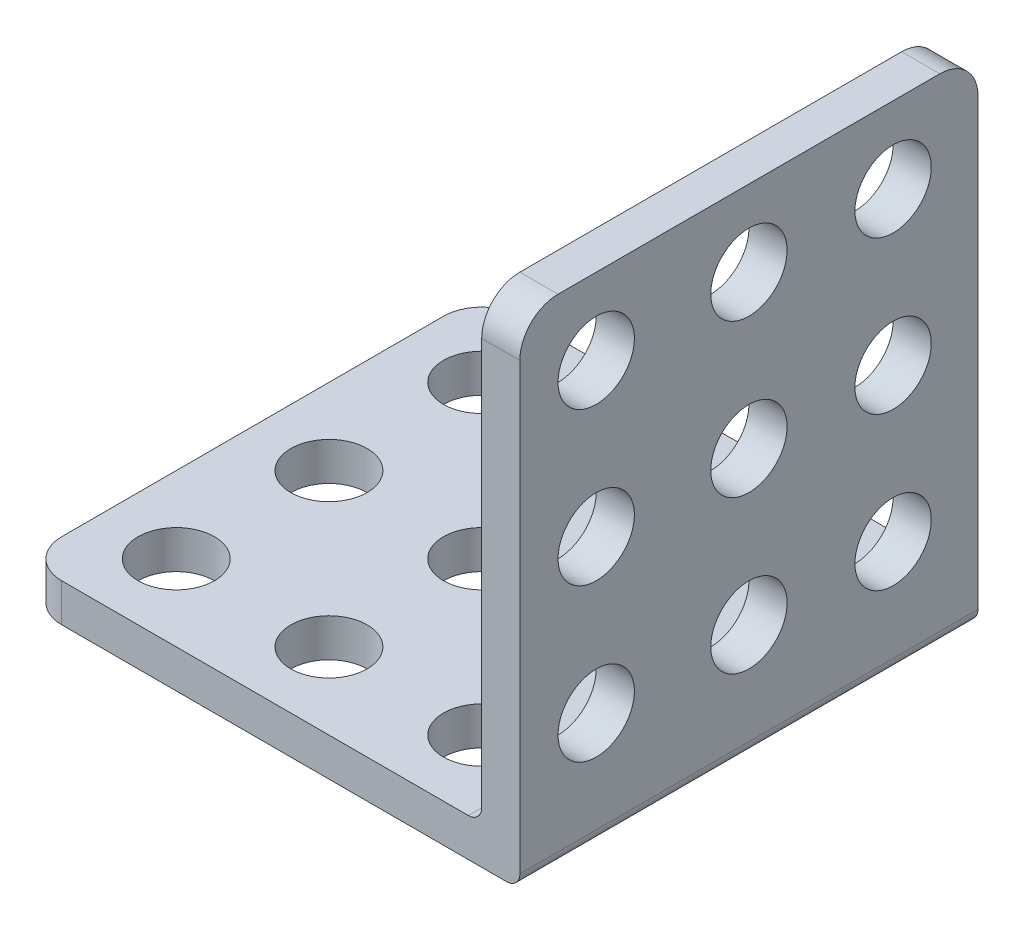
ISO-10303-21;
HEADER;
FILE_DESCRIPTION(('STEP AP214'),'2;1');
FILE_NAME('part.step','',(''),(''),'','','');
FILE_SCHEMA(('AUTOMOTIVE_DESIGN { 1 0 10303 214 1 1 1 1 }'));
ENDSEC;
DATA;
#1=APPLICATION_CONTEXT('core data for automotive mechanical design processes');
#2=APPLICATION_PROTOCOL_DEFINITION('international standard','automotive_design',2000,#1);
#3=PRODUCT_CONTEXT('',#1,'mechanical');
#4=PRODUCT('Part','Part','',(#3));
#5=PRODUCT_RELATED_PRODUCT_CATEGORY('part','',(#4));
#6=PRODUCT_DEFINITION_FORMATION('','',#4);
#7=PRODUCT_DEFINITION_CONTEXT('part definition',#1,'design');
#8=PRODUCT_DEFINITION('design','',#6,#7);
#9=PRODUCT_DEFINITION_SHAPE('','',#8);
#10=(LENGTH_UNIT() NAMED_UNIT(*) SI_UNIT(.MILLI.,.METRE.));
#11=(NAMED_UNIT(*) PLANE_ANGLE_UNIT() SI_UNIT($,.RADIAN.));
#12=(NAMED_UNIT(*) SI_UNIT($,.STERADIAN.) SOLID_ANGLE_UNIT());
#13=UNCERTAINTY_MEASURE_WITH_UNIT(LENGTH_MEASURE(1.E-05),#10,'distance_accuracy_value','');
#14=(GEOMETRIC_REPRESENTATION_CONTEXT(3) GLOBAL_UNCERTAINTY_ASSIGNED_CONTEXT((#13)) GLOBAL_UNIT_ASSIGNED_CONTEXT((#10,
#11,#12)) REPRESENTATION_CONTEXT('',''));
#15=CARTESIAN_POINT('',(0.,0.,0.));
#16=DIRECTION('',(0.,0.,1.));
#17=DIRECTION('',(1.,0.,0.));
#18=AXIS2_PLACEMENT_3D('',#15,#16,#17);
#19=CARTESIAN_POINT('',(0.,2.,0.));
#20=DIRECTION('',(1.,0.,0.));
#21=DIRECTION('',(0.,0.,-1.));
#22=AXIS2_PLACEMENT_3D('',#19,#20,#21);
#23=PLANE('',#22);
#24=DIRECTION('',(0.,0.,1.));
#25=VECTOR('',#24,1.);
#26=CARTESIAN_POINT('',(0.,2.,0.));
#27=LINE('',#26,#25);
#28=CARTESIAN_POINT('',(0.,2.,2.));
#29=VERTEX_POINT('',#28);
#30=CARTESIAN_POINT('',(0.,2.,22.));
#31=VERTEX_POINT('',#30);
#32=EDGE_CURVE('E265',#29,#31,#27,.T.);
#33=ORIENTED_EDGE('',*,*,#32,.F.);
#34=DIRECTION('',(0.,-1.,0.));
#35=VECTOR('',#34,1.);
#36=CARTESIAN_POINT('',(0.,2.,2.));
#37=LINE('',#36,#35);
#38=CARTESIAN_POINT('',(0.,0.,2.));
#39=VERTEX_POINT('',#38);
#40=EDGE_CURVE('E164',#29,#39,#37,.T.);
#41=ORIENTED_EDGE('',*,*,#40,.T.);
#42=DIRECTION('',(0.,0.,1.));
#43=VECTOR('',#42,1.);
#44=CARTESIAN_POINT('',(0.,0.,0.));
#45=LINE('',#44,#43);
#46=CARTESIAN_POINT('',(0.,0.,22.));
#47=VERTEX_POINT('',#46);
#48=EDGE_CURVE('E262',#39,#47,#45,.T.);
#49=ORIENTED_EDGE('',*,*,#48,.T.);
#50=DIRECTION('',(0.,-1.,0.));
#51=VECTOR('',#50,1.);
#52=CARTESIAN_POINT('',(0.,2.,22.));
#53=LINE('',#52,#51);
#54=EDGE_CURVE('E162',#47,#31,#53,.F.);
#55=ORIENTED_EDGE('',*,*,#54,.T.);
#56=EDGE_LOOP('',(#33,#41,#49,#55));
#57=FACE_BOUND('',#56,.T.);
#58=ADVANCED_FACE('F35',(#57),#23,.F.);
#59=CARTESIAN_POINT('',(0.,2.,24.));
#60=DIRECTION('',(0.,0.,-1.));
#61=DIRECTION('',(-1.,0.,0.));
#62=AXIS2_PLACEMENT_3D('',#59,#60,#61);
#63=PLANE('',#62);
#64=DIRECTION('',(1.,0.,0.));
#65=VECTOR('',#64,1.);
#66=CARTESIAN_POINT('',(0.,0.,24.));
#67=LINE('',#66,#65);
#68=CARTESIAN_POINT('',(2.,0.,24.));
#69=VERTEX_POINT('',#68);
#70=CARTESIAN_POINT('',(25.3,0.,24.));
#71=VERTEX_POINT('',#70);
#72=EDGE_CURVE('E272',#69,#71,#67,.T.);
#73=ORIENTED_EDGE('',*,*,#72,.T.);
#74=CARTESIAN_POINT('',(25.3,0.7,24.));
#75=DIRECTION('',(0.,0.,-1.));
#76=DIRECTION('',(-1.,0.,0.));
#77=AXIS2_PLACEMENT_3D('',#74,#75,#76);
#78=CIRCLE('',#77,0.7);
#79=CARTESIAN_POINT('',(26.,0.7,24.));
#80=VERTEX_POINT('',#79);
#81=EDGE_CURVE('E183',#71,#80,#78,.F.);
#82=ORIENTED_EDGE('',*,*,#81,.T.);
#83=DIRECTION('',(0.,-1.,0.));
#84=VECTOR('',#83,1.);
#85=CARTESIAN_POINT('',(26.,2.,24.));
#86=LINE('',#85,#84);
#87=CARTESIAN_POINT('',(26.,24.,24.));
#88=VERTEX_POINT('',#87);
#89=EDGE_CURVE('E135',#88,#80,#86,.T.);
#90=ORIENTED_EDGE('',*,*,#89,.F.);
#91=DIRECTION('',(1.,0.,0.));
#92=VECTOR('',#91,1.);
#93=CARTESIAN_POINT('',(0.,24.,24.));
#94=LINE('',#93,#92);
#95=CARTESIAN_POINT('',(24.,24.,24.));
#96=VERTEX_POINT('',#95);
#97=EDGE_CURVE('E151',#88,#96,#94,.F.);
#98=ORIENTED_EDGE('',*,*,#97,.T.);
#99=DIRECTION('',(0.,-1.,0.));
#100=VECTOR('',#99,1.);
#101=CARTESIAN_POINT('',(24.,26.,24.));
#102=LINE('',#101,#100);
#103=CARTESIAN_POINT('',(24.,2.7,24.));
#104=VERTEX_POINT('',#103);
#105=EDGE_CURVE('E145',#96,#104,#102,.T.);
#106=ORIENTED_EDGE('',*,*,#105,.T.);
#107=CARTESIAN_POINT('',(23.3,2.7,24.));
#108=DIRECTION('',(0.,0.,-1.));
#109=DIRECTION('',(-1.,0.,0.));
#110=AXIS2_PLACEMENT_3D('',#107,#108,#109);
#111=CIRCLE('',#110,0.7);
#112=CARTESIAN_POINT('',(23.3,2.,24.));
#113=VERTEX_POINT('',#112);
#114=EDGE_CURVE('E43',#104,#113,#111,.T.);
#115=ORIENTED_EDGE('',*,*,#114,.T.);
#116=DIRECTION('',(1.,0.,0.));
#117=VECTOR('',#116,1.);
#118=CARTESIAN_POINT('',(0.,2.,24.));
#119=LINE('',#118,#117);
#120=CARTESIAN_POINT('',(2.,2.,24.));
#121=VERTEX_POINT('',#120);
#122=EDGE_CURVE('E193',#121,#113,#119,.T.);
#123=ORIENTED_EDGE('',*,*,#122,.F.);
#124=DIRECTION('',(0.,-1.,0.));
#125=VECTOR('',#124,1.);
#126=CARTESIAN_POINT('',(2.,2.,24.));
#127=LINE('',#126,#125);
#128=EDGE_CURVE('E155',#121,#69,#127,.T.);
#129=ORIENTED_EDGE('',*,*,#128,.T.);
#130=EDGE_LOOP('',(#73,#82,#90,#98,#106,#115,#123,#129));
#131=FACE_BOUND('',#130,.T.);
#132=ADVANCED_FACE('F204',(#131),#63,.F.);
#133=CARTESIAN_POINT('',(26.,2.,0.));
#134=DIRECTION('',(-1.,0.,0.));
#135=DIRECTION('',(0.,0.,1.));
#136=AXIS2_PLACEMENT_3D('',#133,#134,#135);
#137=PLANE('',#136);
#138=CARTESIAN_POINT('',(26.,6.,20.));
#139=DIRECTION('',(-1.,0.,0.));
#140=DIRECTION('',(0.,0.,1.));
#141=AXIS2_PLACEMENT_3D('',#138,#139,#140);
#142=CIRCLE('',#141,2.);
#143=CARTESIAN_POINT('',(26.,6.,22.));
#144=VERTEX_POINT('',#143);
#145=EDGE_CURVE('E417',#144,#144,#142,.T.);
#146=ORIENTED_EDGE('',*,*,#145,.T.);
#147=EDGE_LOOP('',(#146));
#148=FACE_BOUND('',#147,.T.);
#149=CARTESIAN_POINT('',(26.,6.,12.));
#150=DIRECTION('',(-1.,0.,0.));
#151=DIRECTION('',(0.,0.,1.));
#152=AXIS2_PLACEMENT_3D('',#149,#150,#151);
#153=CIRCLE('',#152,2.);
#154=CARTESIAN_POINT('',(26.,6.,14.));
#155=VERTEX_POINT('',#154);
#156=EDGE_CURVE('E408',#155,#155,#153,.T.);
#157=ORIENTED_EDGE('',*,*,#156,.T.);
#158=EDGE_LOOP('',(#157));
#159=FACE_BOUND('',#158,.T.);
#160=CARTESIAN_POINT('',(26.,6.,4.44670842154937));
#161=DIRECTION('',(-1.,0.,0.));
#162=DIRECTION('',(0.,0.,1.));
#163=AXIS2_PLACEMENT_3D('',#160,#161,#162);
#164=CIRCLE('',#163,2.);
#165=CARTESIAN_POINT('',(26.,6.,6.44670842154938));
#166=VERTEX_POINT('',#165);
#167=EDGE_CURVE('E423',#166,#166,#164,.T.);
#168=ORIENTED_EDGE('',*,*,#167,.T.);
#169=EDGE_LOOP('',(#168));
#170=FACE_BOUND('',#169,.T.);
#171=CARTESIAN_POINT('',(26.,14.,20.));
#172=DIRECTION('',(-1.,0.,0.));
#173=DIRECTION('',(0.,0.,1.));
#174=AXIS2_PLACEMENT_3D('',#171,#172,#173);
#175=CIRCLE('',#174,2.);
#176=CARTESIAN_POINT('',(26.,14.,22.));
#177=VERTEX_POINT('',#176);
#178=EDGE_CURVE('E435',#177,#177,#175,.T.);
#179=ORIENTED_EDGE('',*,*,#178,.T.);
#180=EDGE_LOOP('',(#179));
#181=FACE_BOUND('',#180,.T.);
#182=CARTESIAN_POINT('',(26.,14.,12.));
#183=DIRECTION('',(-1.,0.,0.));
#184=DIRECTION('',(0.,0.,1.));
#185=AXIS2_PLACEMENT_3D('',#182,#183,#184);
#186=CIRCLE('',#185,2.);
#187=CARTESIAN_POINT('',(26.,14.,14.));
#188=VERTEX_POINT('',#187);
#189=EDGE_CURVE('E429',#188,#188,#186,.T.);
#190=ORIENTED_EDGE('',*,*,#189,.T.);
#191=EDGE_LOOP('',(#190));
#192=FACE_BOUND('',#191,.T.);
#193=CARTESIAN_POINT('',(26.,14.,4.44670842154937));
#194=DIRECTION('',(-1.,0.,0.));
#195=DIRECTION('',(0.,0.,1.));
#196=AXIS2_PLACEMENT_3D('',#193,#194,#195);
#197=CIRCLE('',#196,2.);
#198=CARTESIAN_POINT('',(26.,14.,6.44670842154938));
#199=VERTEX_POINT('',#198);
#200=EDGE_CURVE('E441',#199,#199,#197,.T.);
#201=ORIENTED_EDGE('',*,*,#200,.T.);
#202=EDGE_LOOP('',(#201));
#203=FACE_BOUND('',#202,.T.);
#204=CARTESIAN_POINT('',(26.,22.,12.));
#205=DIRECTION('',(-1.,0.,0.));
#206=DIRECTION('',(0.,0.,1.));
#207=AXIS2_PLACEMENT_3D('',#204,#205,#206);
#208=CIRCLE('',#207,2.);
#209=CARTESIAN_POINT('',(26.,22.,14.));
#210=VERTEX_POINT('',#209);
#211=EDGE_CURVE('E447',#210,#210,#208,.T.);
#212=ORIENTED_EDGE('',*,*,#211,.T.);
#213=EDGE_LOOP('',(#212));
#214=FACE_BOUND('',#213,.T.);
#215=CARTESIAN_POINT('',(26.,22.,4.44670842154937));
#216=DIRECTION('',(-1.,0.,0.));
#217=DIRECTION('',(0.,0.,1.));
#218=AXIS2_PLACEMENT_3D('',#215,#216,#217);
#219=CIRCLE('',#218,2.);
#220=CARTESIAN_POINT('',(26.,22.,6.44670842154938));
#221=VERTEX_POINT('',#220);
#222=EDGE_CURVE('E453',#221,#221,#219,.T.);
#223=ORIENTED_EDGE('',*,*,#222,.T.);
#224=EDGE_LOOP('',(#223));
#225=FACE_BOUND('',#224,.T.);
#226=CARTESIAN_POINT('',(26.,22.,20.));
#227=DIRECTION('',(-1.,0.,0.));
#228=DIRECTION('',(0.,0.,1.));
#229=AXIS2_PLACEMENT_3D('',#226,#227,#228);
#230=CIRCLE('',#229,2.);
#231=CARTESIAN_POINT('',(26.,22.,22.));
#232=VERTEX_POINT('',#231);
#233=EDGE_CURVE('E450',#232,#232,#230,.T.);
#234=ORIENTED_EDGE('',*,*,#233,.T.);
#235=EDGE_LOOP('',(#234));
#236=FACE_BOUND('',#235,.T.);
#237=ORIENTED_EDGE('',*,*,#89,.T.);
#238=DIRECTION('',(0.,0.,-1.));
#239=VECTOR('',#238,1.);
#240=CARTESIAN_POINT('',(26.,0.7,0.));
#241=LINE('',#240,#239);
#242=CARTESIAN_POINT('',(26.,0.7,0.));
#243=VERTEX_POINT('',#242);
#244=EDGE_CURVE('E176',#80,#243,#241,.T.);
#245=ORIENTED_EDGE('',*,*,#244,.T.);
#246=DIRECTION('',(0.,-1.,0.));
#247=VECTOR('',#246,1.);
#248=CARTESIAN_POINT('',(26.,2.,0.));
#249=LINE('',#248,#247);
#250=CARTESIAN_POINT('',(26.,24.,0.));
#251=VERTEX_POINT('',#250);
#252=EDGE_CURVE('E200',#251,#243,#249,.T.);
#253=ORIENTED_EDGE('',*,*,#252,.F.);
#254=CARTESIAN_POINT('',(26.,24.,2.));
#255=DIRECTION('',(-1.,0.,0.));
#256=DIRECTION('',(0.,0.,1.));
#257=AXIS2_PLACEMENT_3D('',#254,#255,#256);
#258=CIRCLE('',#257,2.);
#259=CARTESIAN_POINT('',(26.,26.,2.));
#260=VERTEX_POINT('',#259);
#261=EDGE_CURVE('E279',#251,#260,#258,.F.);
#262=ORIENTED_EDGE('',*,*,#261,.T.);
#263=DIRECTION('',(0.,0.,1.));
#264=VECTOR('',#263,1.);
#265=CARTESIAN_POINT('',(26.,26.,0.));
#266=LINE('',#265,#264);
#267=CARTESIAN_POINT('',(26.,26.,22.));
#268=VERTEX_POINT('',#267);
#269=EDGE_CURVE('E131',#260,#268,#266,.T.);
#270=ORIENTED_EDGE('',*,*,#269,.T.);
#271=CARTESIAN_POINT('',(26.,24.,22.));
#272=DIRECTION('',(-1.,0.,0.));
#273=DIRECTION('',(0.,0.,1.));
#274=AXIS2_PLACEMENT_3D('',#271,#272,#273);
#275=CIRCLE('',#274,2.);
#276=EDGE_CURVE('E281',#268,#88,#275,.F.);
#277=ORIENTED_EDGE('',*,*,#276,.T.);
#278=EDGE_LOOP('',(#237,#245,#253,#262,#270,#277));
#279=FACE_BOUND('',#278,.T.);
#280=ADVANCED_FACE('F297',(#148,#159,#170,#181,#192,#203,#214,#225,#236,#279),#137,.F.);
#281=CARTESIAN_POINT('',(0.,2.,0.));
#282=DIRECTION('',(0.,0.,1.));
#283=DIRECTION('',(1.,0.,0.));
#284=AXIS2_PLACEMENT_3D('',#281,#282,#283);
#285=PLANE('',#284);
#286=ORIENTED_EDGE('',*,*,#252,.T.);
#287=CARTESIAN_POINT('',(25.3,0.7,0.));
#288=DIRECTION('',(0.,0.,1.));
#289=DIRECTION('',(1.,0.,0.));
#290=AXIS2_PLACEMENT_3D('',#287,#288,#289);
#291=CIRCLE('',#290,0.7);
#292=CARTESIAN_POINT('',(25.3,0.,0.));
#293=VERTEX_POINT('',#292);
#294=EDGE_CURVE('E179',#243,#293,#291,.F.);
#295=ORIENTED_EDGE('',*,*,#294,.T.);
#296=DIRECTION('',(-1.,0.,0.));
#297=VECTOR('',#296,1.);
#298=CARTESIAN_POINT('',(0.,0.,0.));
#299=LINE('',#298,#297);
#300=CARTESIAN_POINT('',(2.,0.,0.));
#301=VERTEX_POINT('',#300);
#302=EDGE_CURVE('E268',#293,#301,#299,.T.);
#303=ORIENTED_EDGE('',*,*,#302,.T.);
#304=DIRECTION('',(0.,-1.,0.));
#305=VECTOR('',#304,1.);
#306=CARTESIAN_POINT('',(2.,2.,0.));
#307=LINE('',#306,#305);
#308=CARTESIAN_POINT('',(2.,2.,0.));
#309=VERTEX_POINT('',#308);
#310=EDGE_CURVE('E153',#301,#309,#307,.F.);
#311=ORIENTED_EDGE('',*,*,#310,.T.);
#312=DIRECTION('',(-1.,0.,0.));
#313=VECTOR('',#312,1.);
#314=CARTESIAN_POINT('',(0.,2.,0.));
#315=LINE('',#314,#313);
#316=CARTESIAN_POINT('',(23.3,2.,0.));
#317=VERTEX_POINT('',#316);
#318=EDGE_CURVE('E192',#317,#309,#315,.T.);
#319=ORIENTED_EDGE('',*,*,#318,.F.);
#320=CARTESIAN_POINT('',(23.3,2.7,0.));
#321=DIRECTION('',(0.,0.,1.));
#322=DIRECTION('',(1.,0.,0.));
#323=AXIS2_PLACEMENT_3D('',#320,#321,#322);
#324=CIRCLE('',#323,0.7);
#325=CARTESIAN_POINT('',(24.,2.7,0.));
#326=VERTEX_POINT('',#325);
#327=EDGE_CURVE('E11',#317,#326,#324,.T.);
#328=ORIENTED_EDGE('',*,*,#327,.T.);
#329=DIRECTION('',(0.,-1.,0.));
#330=VECTOR('',#329,1.);
#331=CARTESIAN_POINT('',(24.,26.,0.));
#332=LINE('',#331,#330);
#333=CARTESIAN_POINT('',(24.,24.,0.));
#334=VERTEX_POINT('',#333);
#335=EDGE_CURVE('E202',#334,#326,#332,.T.);
#336=ORIENTED_EDGE('',*,*,#335,.F.);
#337=DIRECTION('',(1.,0.,0.));
#338=VECTOR('',#337,1.);
#339=CARTESIAN_POINT('',(0.,24.,0.));
#340=LINE('',#339,#338);
#341=EDGE_CURVE('E150',#334,#251,#340,.T.);
#342=ORIENTED_EDGE('',*,*,#341,.T.);
#343=EDGE_LOOP('',(#286,#295,#303,#311,#319,#328,#336,#342));
#344=FACE_BOUND('',#343,.T.);
#345=ADVANCED_FACE('F197',(#344),#285,.F.);
#346=CARTESIAN_POINT('',(0.,2.,0.));
#347=DIRECTION('',(0.,1.,0.));
#348=DIRECTION('',(0.,0.,1.));
#349=AXIS2_PLACEMENT_3D('',#346,#347,#348);
#350=PLANE('',#349);
#351=ORIENTED_EDGE('',*,*,#122,.T.);
#352=DIRECTION('',(0.,0.,1.));
#353=VECTOR('',#352,1.);
#354=CARTESIAN_POINT('',(23.3,2.,0.));
#355=LINE('',#354,#353);
#356=EDGE_CURVE('E187',#113,#317,#355,.F.);
#357=ORIENTED_EDGE('',*,*,#356,.T.);
#358=ORIENTED_EDGE('',*,*,#318,.T.);
#359=CARTESIAN_POINT('',(2.,2.,2.));
#360=DIRECTION('',(0.,1.,0.));
#361=DIRECTION('',(0.,0.,1.));
#362=AXIS2_PLACEMENT_3D('',#359,#360,#361);
#363=CIRCLE('',#362,2.);
#364=EDGE_CURVE('E174',#309,#29,#363,.T.);
#365=ORIENTED_EDGE('',*,*,#364,.T.);
#366=ORIENTED_EDGE('',*,*,#32,.T.);
#367=CARTESIAN_POINT('',(2.,2.,22.));
#368=DIRECTION('',(0.,1.,0.));
#369=DIRECTION('',(0.,0.,1.));
#370=AXIS2_PLACEMENT_3D('',#367,#368,#369);
#371=CIRCLE('',#370,2.);
#372=EDGE_CURVE('E172',#31,#121,#371,.T.);
#373=ORIENTED_EDGE('',*,*,#372,.T.);
#374=EDGE_LOOP('',(#351,#357,#358,#365,#366,#373));
#375=FACE_BOUND('',#374,.T.);
#376=CARTESIAN_POINT('',(12.,2.,12.));
#377=DIRECTION('',(0.,1.,0.));
#378=DIRECTION('',(0.,0.,1.));
#379=AXIS2_PLACEMENT_3D('',#376,#377,#378);
#380=CIRCLE('',#379,2.);
#381=CARTESIAN_POINT('',(12.,2.,14.));
#382=VERTEX_POINT('',#381);
#383=EDGE_CURVE('E235',#382,#382,#380,.T.);
#384=ORIENTED_EDGE('',*,*,#383,.F.);
#385=EDGE_LOOP('',(#384));
#386=FACE_BOUND('',#385,.T.);
#387=CARTESIAN_POINT('',(12.,2.,4.));
#388=DIRECTION('',(0.,1.,0.));
#389=DIRECTION('',(0.,0.,1.));
#390=AXIS2_PLACEMENT_3D('',#387,#388,#389);
#391=CIRCLE('',#390,2.);
#392=CARTESIAN_POINT('',(12.,2.,6.));
#393=VERTEX_POINT('',#392);
#394=EDGE_CURVE('E242',#393,#393,#391,.T.);
#395=ORIENTED_EDGE('',*,*,#394,.F.);
#396=EDGE_LOOP('',(#395));
#397=FACE_BOUND('',#396,.T.);
#398=CARTESIAN_POINT('',(20.,2.,4.));
#399=DIRECTION('',(0.,1.,0.));
#400=DIRECTION('',(0.,0.,1.));
#401=AXIS2_PLACEMENT_3D('',#398,#399,#400);
#402=CIRCLE('',#401,2.);
#403=CARTESIAN_POINT('',(20.,2.,6.));
#404=VERTEX_POINT('',#403);
#405=EDGE_CURVE('E248',#404,#404,#402,.T.);
#406=ORIENTED_EDGE('',*,*,#405,.F.);
#407=EDGE_LOOP('',(#406));
#408=FACE_BOUND('',#407,.T.);
#409=CARTESIAN_POINT('',(20.,2.,12.));
#410=DIRECTION('',(0.,1.,0.));
#411=DIRECTION('',(0.,0.,1.));
#412=AXIS2_PLACEMENT_3D('',#409,#410,#411);
#413=CIRCLE('',#412,2.);
#414=CARTESIAN_POINT('',(20.,2.,14.));
#415=VERTEX_POINT('',#414);
#416=EDGE_CURVE('E254',#415,#415,#413,.T.);
#417=ORIENTED_EDGE('',*,*,#416,.F.);
#418=EDGE_LOOP('',(#417));
#419=FACE_BOUND('',#418,.T.);
#420=CARTESIAN_POINT('',(20.,2.,20.));
#421=DIRECTION('',(0.,1.,0.));
#422=DIRECTION('',(0.,0.,1.));
#423=AXIS2_PLACEMENT_3D('',#420,#421,#422);
#424=CIRCLE('',#423,2.);
#425=CARTESIAN_POINT('',(20.,2.,22.));
#426=VERTEX_POINT('',#425);
#427=EDGE_CURVE('E211',#426,#426,#424,.T.);
#428=ORIENTED_EDGE('',*,*,#427,.F.);
#429=EDGE_LOOP('',(#428));
#430=FACE_BOUND('',#429,.T.);
#431=CARTESIAN_POINT('',(12.,2.,20.));
#432=DIRECTION('',(0.,1.,0.));
#433=DIRECTION('',(0.,0.,1.));
#434=AXIS2_PLACEMENT_3D('',#431,#432,#433);
#435=CIRCLE('',#434,2.);
#436=CARTESIAN_POINT('',(12.,2.,22.));
#437=VERTEX_POINT('',#436);
#438=EDGE_CURVE('E218',#437,#437,#435,.T.);
#439=ORIENTED_EDGE('',*,*,#438,.F.);
#440=EDGE_LOOP('',(#439));
#441=FACE_BOUND('',#440,.T.);
#442=CARTESIAN_POINT('',(4.,2.,20.));
#443=DIRECTION('',(0.,1.,0.));
#444=DIRECTION('',(0.,0.,1.));
#445=AXIS2_PLACEMENT_3D('',#442,#443,#444);
#446=CIRCLE('',#445,2.);
#447=CARTESIAN_POINT('',(4.,2.,22.));
#448=VERTEX_POINT('',#447);
#449=EDGE_CURVE('E224',#448,#448,#446,.T.);
#450=ORIENTED_EDGE('',*,*,#449,.F.);
#451=EDGE_LOOP('',(#450));
#452=FACE_BOUND('',#451,.T.);
#453=CARTESIAN_POINT('',(4.,2.,4.));
#454=DIRECTION('',(0.,1.,0.));
#455=DIRECTION('',(0.,0.,1.));
#456=AXIS2_PLACEMENT_3D('',#453,#454,#455);
#457=CIRCLE('',#456,2.);
#458=CARTESIAN_POINT('',(4.,2.,6.));
#459=VERTEX_POINT('',#458);
#460=EDGE_CURVE('E230',#459,#459,#457,.T.);
#461=ORIENTED_EDGE('',*,*,#460,.F.);
#462=EDGE_LOOP('',(#461));
#463=FACE_BOUND('',#462,.T.);
#464=CARTESIAN_POINT('',(4.,2.,12.));
#465=DIRECTION('',(0.,1.,0.));
#466=DIRECTION('',(0.,0.,1.));
#467=AXIS2_PLACEMENT_3D('',#464,#465,#466);
#468=CIRCLE('',#467,2.);
#469=CARTESIAN_POINT('',(4.,2.,14.));
#470=VERTEX_POINT('',#469);
#471=EDGE_CURVE('E238',#470,#470,#468,.T.);
#472=ORIENTED_EDGE('',*,*,#471,.F.);
#473=EDGE_LOOP('',(#472));
#474=FACE_BOUND('',#473,.T.);
#475=ADVANCED_FACE('F190',(#375,#386,#397,#408,#419,#430,#441,#452,#463,#474),#350,.T.);
#476=CARTESIAN_POINT('',(0.,0.,0.));
#477=DIRECTION('',(0.,1.,0.));
#478=DIRECTION('',(0.,0.,1.));
#479=AXIS2_PLACEMENT_3D('',#476,#477,#478);
#480=PLANE('',#479);
#481=CARTESIAN_POINT('',(12.,0.,12.));
#482=DIRECTION('',(0.,1.,0.));
#483=DIRECTION('',(0.,0.,1.));
#484=AXIS2_PLACEMENT_3D('',#481,#482,#483);
#485=CIRCLE('',#484,2.);
#486=CARTESIAN_POINT('',(12.,0.,14.));
#487=VERTEX_POINT('',#486);
#488=EDGE_CURVE('E239',#487,#487,#485,.T.);
#489=ORIENTED_EDGE('',*,*,#488,.T.);
#490=EDGE_LOOP('',(#489));
#491=FACE_BOUND('',#490,.T.);
#492=CARTESIAN_POINT('',(12.,0.,4.));
#493=DIRECTION('',(0.,1.,0.));
#494=DIRECTION('',(0.,0.,1.));
#495=AXIS2_PLACEMENT_3D('',#492,#493,#494);
#496=CIRCLE('',#495,2.);
#497=CARTESIAN_POINT('',(12.,0.,6.));
#498=VERTEX_POINT('',#497);
#499=EDGE_CURVE('E245',#498,#498,#496,.T.);
#500=ORIENTED_EDGE('',*,*,#499,.T.);
#501=EDGE_LOOP('',(#500));
#502=FACE_BOUND('',#501,.T.);
#503=CARTESIAN_POINT('',(20.,0.,4.));
#504=DIRECTION('',(0.,1.,0.));
#505=DIRECTION('',(0.,0.,1.));
#506=AXIS2_PLACEMENT_3D('',#503,#504,#505);
#507=CIRCLE('',#506,2.);
#508=CARTESIAN_POINT('',(20.,0.,6.));
#509=VERTEX_POINT('',#508);
#510=EDGE_CURVE('E251',#509,#509,#507,.T.);
#511=ORIENTED_EDGE('',*,*,#510,.T.);
#512=EDGE_LOOP('',(#511));
#513=FACE_BOUND('',#512,.T.);
#514=CARTESIAN_POINT('',(20.,0.,12.));
#515=DIRECTION('',(0.,1.,0.));
#516=DIRECTION('',(0.,0.,1.));
#517=AXIS2_PLACEMENT_3D('',#514,#515,#516);
#518=CIRCLE('',#517,2.);
#519=CARTESIAN_POINT('',(20.,0.,14.));
#520=VERTEX_POINT('',#519);
#521=EDGE_CURVE('E214',#520,#520,#518,.T.);
#522=ORIENTED_EDGE('',*,*,#521,.T.);
#523=EDGE_LOOP('',(#522));
#524=FACE_BOUND('',#523,.T.);
#525=CARTESIAN_POINT('',(20.,0.,20.));
#526=DIRECTION('',(0.,1.,0.));
#527=DIRECTION('',(0.,0.,1.));
#528=AXIS2_PLACEMENT_3D('',#525,#526,#527);
#529=CIRCLE('',#528,2.);
#530=CARTESIAN_POINT('',(20.,0.,22.));
#531=VERTEX_POINT('',#530);
#532=EDGE_CURVE('E215',#531,#531,#529,.T.);
#533=ORIENTED_EDGE('',*,*,#532,.T.);
#534=EDGE_LOOP('',(#533));
#535=FACE_BOUND('',#534,.T.);
#536=CARTESIAN_POINT('',(12.,0.,20.));
#537=DIRECTION('',(0.,1.,0.));
#538=DIRECTION('',(0.,0.,1.));
#539=AXIS2_PLACEMENT_3D('',#536,#537,#538);
#540=CIRCLE('',#539,2.);
#541=CARTESIAN_POINT('',(12.,0.,22.));
#542=VERTEX_POINT('',#541);
#543=EDGE_CURVE('E221',#542,#542,#540,.T.);
#544=ORIENTED_EDGE('',*,*,#543,.T.);
#545=EDGE_LOOP('',(#544));
#546=FACE_BOUND('',#545,.T.);
#547=CARTESIAN_POINT('',(4.,0.,20.));
#548=DIRECTION('',(0.,1.,0.));
#549=DIRECTION('',(0.,0.,1.));
#550=AXIS2_PLACEMENT_3D('',#547,#548,#549);
#551=CIRCLE('',#550,2.);
#552=CARTESIAN_POINT('',(4.,0.,22.));
#553=VERTEX_POINT('',#552);
#554=EDGE_CURVE('E227',#553,#553,#551,.T.);
#555=ORIENTED_EDGE('',*,*,#554,.T.);
#556=EDGE_LOOP('',(#555));
#557=FACE_BOUND('',#556,.T.);
#558=CARTESIAN_POINT('',(4.,0.,4.));
#559=DIRECTION('',(0.,1.,0.));
#560=DIRECTION('',(0.,0.,1.));
#561=AXIS2_PLACEMENT_3D('',#558,#559,#560);
#562=CIRCLE('',#561,2.);
#563=CARTESIAN_POINT('',(4.,0.,6.));
#564=VERTEX_POINT('',#563);
#565=EDGE_CURVE('E208',#564,#564,#562,.T.);
#566=ORIENTED_EDGE('',*,*,#565,.T.);
#567=EDGE_LOOP('',(#566));
#568=FACE_BOUND('',#567,.T.);
#569=CARTESIAN_POINT('',(4.,0.,12.));
#570=DIRECTION('',(0.,1.,0.));
#571=DIRECTION('',(0.,0.,1.));
#572=AXIS2_PLACEMENT_3D('',#569,#570,#571);
#573=CIRCLE('',#572,2.);
#574=CARTESIAN_POINT('',(4.,0.,14.));
#575=VERTEX_POINT('',#574);
#576=EDGE_CURVE('E259',#575,#575,#573,.T.);
#577=ORIENTED_EDGE('',*,*,#576,.T.);
#578=EDGE_LOOP('',(#577));
#579=FACE_BOUND('',#578,.T.);
#580=ORIENTED_EDGE('',*,*,#302,.F.);
#581=DIRECTION('',(0.,0.,-1.));
#582=VECTOR('',#581,1.);
#583=CARTESIAN_POINT('',(25.3,0.,0.));
#584=LINE('',#583,#582);
#585=EDGE_CURVE('E181',#293,#71,#584,.F.);
#586=ORIENTED_EDGE('',*,*,#585,.T.);
#587=ORIENTED_EDGE('',*,*,#72,.F.);
#588=CARTESIAN_POINT('',(2.,0.,22.));
#589=DIRECTION('',(0.,1.,0.));
#590=DIRECTION('',(0.,0.,1.));
#591=AXIS2_PLACEMENT_3D('',#588,#589,#590);
#592=CIRCLE('',#591,2.);
#593=EDGE_CURVE('E167',#69,#47,#592,.F.);
#594=ORIENTED_EDGE('',*,*,#593,.T.);
#595=ORIENTED_EDGE('',*,*,#48,.F.);
#596=CARTESIAN_POINT('',(2.,0.,2.));
#597=DIRECTION('',(0.,1.,0.));
#598=DIRECTION('',(0.,0.,1.));
#599=AXIS2_PLACEMENT_3D('',#596,#597,#598);
#600=CIRCLE('',#599,2.);
#601=EDGE_CURVE('E169',#39,#301,#600,.F.);
#602=ORIENTED_EDGE('',*,*,#601,.T.);
#603=EDGE_LOOP('',(#580,#586,#587,#594,#595,#602));
#604=FACE_BOUND('',#603,.T.);
#605=ADVANCED_FACE('F290',(#491,#502,#513,#524,#535,#546,#557,#568,#579,#604),#480,.F.);
#606=CARTESIAN_POINT('',(4.,0.,12.));
#607=DIRECTION('',(0.,1.,0.));
#608=DIRECTION('',(0.,0.,1.));
#609=AXIS2_PLACEMENT_3D('',#606,#607,#608);
#610=CYLINDRICAL_SURFACE('',#609,2.);
#611=ORIENTED_EDGE('',*,*,#576,.F.);
#612=EDGE_LOOP('',(#611));
#613=FACE_BOUND('',#612,.T.);
#614=ORIENTED_EDGE('',*,*,#471,.T.);
#615=EDGE_LOOP('',(#614));
#616=FACE_BOUND('',#615,.T.);
#617=ADVANCED_FACE('F329',(#613,#616),#610,.F.);
#618=CARTESIAN_POINT('',(4.,0.,4.));
#619=DIRECTION('',(0.,1.,0.));
#620=DIRECTION('',(0.,0.,1.));
#621=AXIS2_PLACEMENT_3D('',#618,#619,#620);
#622=CYLINDRICAL_SURFACE('',#621,2.);
#623=ORIENTED_EDGE('',*,*,#565,.F.);
#624=EDGE_LOOP('',(#623));
#625=FACE_BOUND('',#624,.T.);
#626=ORIENTED_EDGE('',*,*,#460,.T.);
#627=EDGE_LOOP('',(#626));
#628=FACE_BOUND('',#627,.T.);
#629=ADVANCED_FACE('F335',(#625,#628),#622,.F.);
#630=CARTESIAN_POINT('',(4.,0.,20.));
#631=DIRECTION('',(0.,1.,0.));
#632=DIRECTION('',(0.,0.,1.));
#633=AXIS2_PLACEMENT_3D('',#630,#631,#632);
#634=CYLINDRICAL_SURFACE('',#633,2.);
#635=ORIENTED_EDGE('',*,*,#554,.F.);
#636=EDGE_LOOP('',(#635));
#637=FACE_BOUND('',#636,.T.);
#638=ORIENTED_EDGE('',*,*,#449,.T.);
#639=EDGE_LOOP('',(#638));
#640=FACE_BOUND('',#639,.T.);
#641=ADVANCED_FACE('F356',(#637,#640),#634,.F.);
#642=CARTESIAN_POINT('',(12.,0.,20.));
#643=DIRECTION('',(0.,1.,0.));
#644=DIRECTION('',(0.,0.,1.));
#645=AXIS2_PLACEMENT_3D('',#642,#643,#644);
#646=CYLINDRICAL_SURFACE('',#645,2.);
#647=ORIENTED_EDGE('',*,*,#543,.F.);
#648=EDGE_LOOP('',(#647));
#649=FACE_BOUND('',#648,.T.);
#650=ORIENTED_EDGE('',*,*,#438,.T.);
#651=EDGE_LOOP('',(#650));
#652=FACE_BOUND('',#651,.T.);
#653=ADVANCED_FACE('F360',(#649,#652),#646,.F.);
#654=CARTESIAN_POINT('',(20.,0.,20.));
#655=DIRECTION('',(0.,1.,0.));
#656=DIRECTION('',(0.,0.,1.));
#657=AXIS2_PLACEMENT_3D('',#654,#655,#656);
#658=CYLINDRICAL_SURFACE('',#657,2.);
#659=ORIENTED_EDGE('',*,*,#532,.F.);
#660=EDGE_LOOP('',(#659));
#661=FACE_BOUND('',#660,.T.);
#662=ORIENTED_EDGE('',*,*,#427,.T.);
#663=EDGE_LOOP('',(#662));
#664=FACE_BOUND('',#663,.T.);
#665=ADVANCED_FACE('F341',(#661,#664),#658,.F.);
#666=CARTESIAN_POINT('',(20.,0.,12.));
#667=DIRECTION('',(0.,1.,0.));
#668=DIRECTION('',(0.,0.,1.));
#669=AXIS2_PLACEMENT_3D('',#666,#667,#668);
#670=CYLINDRICAL_SURFACE('',#669,2.);
#671=ORIENTED_EDGE('',*,*,#521,.F.);
#672=EDGE_LOOP('',(#671));
#673=FACE_BOUND('',#672,.T.);
#674=ORIENTED_EDGE('',*,*,#416,.T.);
#675=EDGE_LOOP('',(#674));
#676=FACE_BOUND('',#675,.T.);
#677=ADVANCED_FACE('F337',(#673,#676),#670,.F.);
#678=CARTESIAN_POINT('',(20.,0.,4.));
#679=DIRECTION('',(0.,1.,0.));
#680=DIRECTION('',(0.,0.,1.));
#681=AXIS2_PLACEMENT_3D('',#678,#679,#680);
#682=CYLINDRICAL_SURFACE('',#681,2.);
#683=ORIENTED_EDGE('',*,*,#510,.F.);
#684=EDGE_LOOP('',(#683));
#685=FACE_BOUND('',#684,.T.);
#686=ORIENTED_EDGE('',*,*,#405,.T.);
#687=EDGE_LOOP('',(#686));
#688=FACE_BOUND('',#687,.T.);
#689=ADVANCED_FACE('F340',(#685,#688),#682,.F.);
#690=CARTESIAN_POINT('',(12.,0.,4.));
#691=DIRECTION('',(0.,1.,0.));
#692=DIRECTION('',(0.,0.,1.));
#693=AXIS2_PLACEMENT_3D('',#690,#691,#692);
#694=CYLINDRICAL_SURFACE('',#693,2.);
#695=ORIENTED_EDGE('',*,*,#499,.F.);
#696=EDGE_LOOP('',(#695));
#697=FACE_BOUND('',#696,.T.);
#698=ORIENTED_EDGE('',*,*,#394,.T.);
#699=EDGE_LOOP('',(#698));
#700=FACE_BOUND('',#699,.T.);
#701=ADVANCED_FACE('F345',(#697,#700),#694,.F.);
#702=CARTESIAN_POINT('',(12.,0.,12.));
#703=DIRECTION('',(0.,1.,0.));
#704=DIRECTION('',(0.,0.,1.));
#705=AXIS2_PLACEMENT_3D('',#702,#703,#704);
#706=CYLINDRICAL_SURFACE('',#705,2.);
#707=ORIENTED_EDGE('',*,*,#488,.F.);
#708=EDGE_LOOP('',(#707));
#709=FACE_BOUND('',#708,.T.);
#710=ORIENTED_EDGE('',*,*,#383,.T.);
#711=EDGE_LOOP('',(#710));
#712=FACE_BOUND('',#711,.T.);
#713=ADVANCED_FACE('F349',(#709,#712),#706,.F.);
#714=CARTESIAN_POINT('',(24.,26.,0.));
#715=DIRECTION('',(1.,0.,0.));
#716=DIRECTION('',(0.,0.,-1.));
#717=AXIS2_PLACEMENT_3D('',#714,#715,#716);
#718=PLANE('',#717);
#719=CARTESIAN_POINT('',(24.,6.,20.));
#720=DIRECTION('',(-1.,0.,0.));
#721=DIRECTION('',(0.,0.,1.));
#722=AXIS2_PLACEMENT_3D('',#719,#720,#721);
#723=CIRCLE('',#722,2.);
#724=CARTESIAN_POINT('',(24.,6.,22.));
#725=VERTEX_POINT('',#724);
#726=EDGE_CURVE('E414',#725,#725,#723,.T.);
#727=ORIENTED_EDGE('',*,*,#726,.F.);
#728=EDGE_LOOP('',(#727));
#729=FACE_BOUND('',#728,.T.);
#730=CARTESIAN_POINT('',(24.,6.,12.));
#731=DIRECTION('',(-1.,0.,0.));
#732=DIRECTION('',(0.,0.,1.));
#733=AXIS2_PLACEMENT_3D('',#730,#731,#732);
#734=CIRCLE('',#733,2.);
#735=CARTESIAN_POINT('',(24.,6.,14.));
#736=VERTEX_POINT('',#735);
#737=EDGE_CURVE('E411',#736,#736,#734,.T.);
#738=ORIENTED_EDGE('',*,*,#737,.F.);
#739=EDGE_LOOP('',(#738));
#740=FACE_BOUND('',#739,.T.);
#741=CARTESIAN_POINT('',(24.,6.,4.44670842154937));
#742=DIRECTION('',(-1.,0.,0.));
#743=DIRECTION('',(0.,0.,1.));
#744=AXIS2_PLACEMENT_3D('',#741,#742,#743);
#745=CIRCLE('',#744,2.);
#746=CARTESIAN_POINT('',(24.,6.,6.44670842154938));
#747=VERTEX_POINT('',#746);
#748=EDGE_CURVE('E420',#747,#747,#745,.T.);
#749=ORIENTED_EDGE('',*,*,#748,.F.);
#750=EDGE_LOOP('',(#749));
#751=FACE_BOUND('',#750,.T.);
#752=CARTESIAN_POINT('',(24.,14.,20.));
#753=DIRECTION('',(-1.,0.,0.));
#754=DIRECTION('',(0.,0.,1.));
#755=AXIS2_PLACEMENT_3D('',#752,#753,#754);
#756=CIRCLE('',#755,2.);
#757=CARTESIAN_POINT('',(24.,14.,22.));
#758=VERTEX_POINT('',#757);
#759=EDGE_CURVE('E432',#758,#758,#756,.T.);
#760=ORIENTED_EDGE('',*,*,#759,.F.);
#761=EDGE_LOOP('',(#760));
#762=FACE_BOUND('',#761,.T.);
#763=CARTESIAN_POINT('',(24.,14.,12.));
#764=DIRECTION('',(-1.,0.,0.));
#765=DIRECTION('',(0.,0.,1.));
#766=AXIS2_PLACEMENT_3D('',#763,#764,#765);
#767=CIRCLE('',#766,2.);
#768=CARTESIAN_POINT('',(24.,14.,14.));
#769=VERTEX_POINT('',#768);
#770=EDGE_CURVE('E426',#769,#769,#767,.T.);
#771=ORIENTED_EDGE('',*,*,#770,.F.);
#772=EDGE_LOOP('',(#771));
#773=FACE_BOUND('',#772,.T.);
#774=CARTESIAN_POINT('',(24.,14.,4.44670842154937));
#775=DIRECTION('',(-1.,0.,0.));
#776=DIRECTION('',(0.,0.,1.));
#777=AXIS2_PLACEMENT_3D('',#774,#775,#776);
#778=CIRCLE('',#777,2.);
#779=CARTESIAN_POINT('',(24.,14.,6.44670842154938));
#780=VERTEX_POINT('',#779);
#781=EDGE_CURVE('E438',#780,#780,#778,.T.);
#782=ORIENTED_EDGE('',*,*,#781,.F.);
#783=EDGE_LOOP('',(#782));
#784=FACE_BOUND('',#783,.T.);
#785=CARTESIAN_POINT('',(24.,22.,12.));
#786=DIRECTION('',(-1.,0.,0.));
#787=DIRECTION('',(0.,0.,1.));
#788=AXIS2_PLACEMENT_3D('',#785,#786,#787);
#789=CIRCLE('',#788,2.);
#790=CARTESIAN_POINT('',(24.,22.,14.));
#791=VERTEX_POINT('',#790);
#792=EDGE_CURVE('E444',#791,#791,#789,.T.);
#793=ORIENTED_EDGE('',*,*,#792,.F.);
#794=EDGE_LOOP('',(#793));
#795=FACE_BOUND('',#794,.T.);
#796=CARTESIAN_POINT('',(24.,22.,4.44670842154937));
#797=DIRECTION('',(-1.,0.,0.));
#798=DIRECTION('',(0.,0.,1.));
#799=AXIS2_PLACEMENT_3D('',#796,#797,#798);
#800=CIRCLE('',#799,2.);
#801=CARTESIAN_POINT('',(24.,22.,6.44670842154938));
#802=VERTEX_POINT('',#801);
#803=EDGE_CURVE('E456',#802,#802,#800,.T.);
#804=ORIENTED_EDGE('',*,*,#803,.F.);
#805=EDGE_LOOP('',(#804));
#806=FACE_BOUND('',#805,.T.);
#807=CARTESIAN_POINT('',(24.,22.,20.));
#808=DIRECTION('',(-1.,0.,0.));
#809=DIRECTION('',(0.,0.,1.));
#810=AXIS2_PLACEMENT_3D('',#807,#808,#809);
#811=CIRCLE('',#810,2.);
#812=CARTESIAN_POINT('',(24.,22.,22.));
#813=VERTEX_POINT('',#812);
#814=EDGE_CURVE('E459',#813,#813,#811,.T.);
#815=ORIENTED_EDGE('',*,*,#814,.F.);
#816=EDGE_LOOP('',(#815));
#817=FACE_BOUND('',#816,.T.);
#818=ORIENTED_EDGE('',*,*,#335,.T.);
#819=DIRECTION('',(0.,0.,1.));
#820=VECTOR('',#819,1.);
#821=CARTESIAN_POINT('',(24.,2.7,0.));
#822=LINE('',#821,#820);
#823=EDGE_CURVE('E185',#326,#104,#822,.T.);
#824=ORIENTED_EDGE('',*,*,#823,.T.);
#825=ORIENTED_EDGE('',*,*,#105,.F.);
#826=CARTESIAN_POINT('',(24.,24.,22.));
#827=DIRECTION('',(1.,0.,0.));
#828=DIRECTION('',(0.,0.,-1.));
#829=AXIS2_PLACEMENT_3D('',#826,#827,#828);
#830=CIRCLE('',#829,2.);
#831=CARTESIAN_POINT('',(24.,26.,22.));
#832=VERTEX_POINT('',#831);
#833=EDGE_CURVE('E144',#96,#832,#830,.F.);
#834=ORIENTED_EDGE('',*,*,#833,.T.);
#835=DIRECTION('',(0.,0.,1.));
#836=VECTOR('',#835,1.);
#837=CARTESIAN_POINT('',(24.,26.,0.));
#838=LINE('',#837,#836);
#839=CARTESIAN_POINT('',(24.,26.,2.));
#840=VERTEX_POINT('',#839);
#841=EDGE_CURVE('E128',#840,#832,#838,.T.);
#842=ORIENTED_EDGE('',*,*,#841,.F.);
#843=CARTESIAN_POINT('',(24.,24.,2.));
#844=DIRECTION('',(1.,0.,0.));
#845=DIRECTION('',(0.,0.,-1.));
#846=AXIS2_PLACEMENT_3D('',#843,#844,#845);
#847=CIRCLE('',#846,2.);
#848=EDGE_CURVE('E140',#840,#334,#847,.F.);
#849=ORIENTED_EDGE('',*,*,#848,.T.);
#850=EDGE_LOOP('',(#818,#824,#825,#834,#842,#849));
#851=FACE_BOUND('',#850,.T.);
#852=ADVANCED_FACE('F139',(#729,#740,#751,#762,#773,#784,#795,#806,#817,#851),#718,.F.);
#853=CARTESIAN_POINT('',(0.,26.,0.));
#854=DIRECTION('',(0.,-1.,0.));
#855=DIRECTION('',(0.,0.,-1.));
#856=AXIS2_PLACEMENT_3D('',#853,#854,#855);
#857=PLANE('',#856);
#858=ORIENTED_EDGE('',*,*,#841,.T.);
#859=DIRECTION('',(1.,0.,0.));
#860=VECTOR('',#859,1.);
#861=CARTESIAN_POINT('',(0.,26.,22.));
#862=LINE('',#861,#860);
#863=EDGE_CURVE('E134',#832,#268,#862,.T.);
#864=ORIENTED_EDGE('',*,*,#863,.T.);
#865=ORIENTED_EDGE('',*,*,#269,.F.);
#866=DIRECTION('',(1.,0.,0.));
#867=VECTOR('',#866,1.);
#868=CARTESIAN_POINT('',(0.,26.,2.));
#869=LINE('',#868,#867);
#870=EDGE_CURVE('E124',#260,#840,#869,.F.);
#871=ORIENTED_EDGE('',*,*,#870,.T.);
#872=EDGE_LOOP('',(#858,#864,#865,#871));
#873=FACE_BOUND('',#872,.T.);
#874=ADVANCED_FACE('F126',(#873),#857,.F.);
#875=CARTESIAN_POINT('',(26.,22.,20.));
#876=DIRECTION('',(-1.,0.,0.));
#877=DIRECTION('',(0.,0.,1.));
#878=AXIS2_PLACEMENT_3D('',#875,#876,#877);
#879=CYLINDRICAL_SURFACE('',#878,2.);
#880=ORIENTED_EDGE('',*,*,#233,.F.);
#881=EDGE_LOOP('',(#880));
#882=FACE_BOUND('',#881,.T.);
#883=ORIENTED_EDGE('',*,*,#814,.T.);
#884=EDGE_LOOP('',(#883));
#885=FACE_BOUND('',#884,.T.);
#886=ADVANCED_FACE('F373',(#882,#885),#879,.F.);
#887=CARTESIAN_POINT('',(26.,22.,4.44670842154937));
#888=DIRECTION('',(-1.,0.,0.));
#889=DIRECTION('',(0.,0.,1.));
#890=AXIS2_PLACEMENT_3D('',#887,#888,#889);
#891=CYLINDRICAL_SURFACE('',#890,2.);
#892=ORIENTED_EDGE('',*,*,#222,.F.);
#893=EDGE_LOOP('',(#892));
#894=FACE_BOUND('',#893,.T.);
#895=ORIENTED_EDGE('',*,*,#803,.T.);
#896=EDGE_LOOP('',(#895));
#897=FACE_BOUND('',#896,.T.);
#898=ADVANCED_FACE('F376',(#894,#897),#891,.F.);
#899=CARTESIAN_POINT('',(26.,22.,12.));
#900=DIRECTION('',(-1.,0.,0.));
#901=DIRECTION('',(0.,0.,1.));
#902=AXIS2_PLACEMENT_3D('',#899,#900,#901);
#903=CYLINDRICAL_SURFACE('',#902,2.);
#904=ORIENTED_EDGE('',*,*,#211,.F.);
#905=EDGE_LOOP('',(#904));
#906=FACE_BOUND('',#905,.T.);
#907=ORIENTED_EDGE('',*,*,#792,.T.);
#908=EDGE_LOOP('',(#907));
#909=FACE_BOUND('',#908,.T.);
#910=ADVANCED_FACE('F380',(#906,#909),#903,.F.);
#911=CARTESIAN_POINT('',(26.,14.,4.44670842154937));
#912=DIRECTION('',(-1.,0.,0.));
#913=DIRECTION('',(0.,0.,1.));
#914=AXIS2_PLACEMENT_3D('',#911,#912,#913);
#915=CYLINDRICAL_SURFACE('',#914,2.);
#916=ORIENTED_EDGE('',*,*,#200,.F.);
#917=EDGE_LOOP('',(#916));
#918=FACE_BOUND('',#917,.T.);
#919=ORIENTED_EDGE('',*,*,#781,.T.);
#920=EDGE_LOOP('',(#919));
#921=FACE_BOUND('',#920,.T.);
#922=ADVANCED_FACE('F384',(#918,#921),#915,.F.);
#923=CARTESIAN_POINT('',(26.,14.,12.));
#924=DIRECTION('',(-1.,0.,0.));
#925=DIRECTION('',(0.,0.,1.));
#926=AXIS2_PLACEMENT_3D('',#923,#924,#925);
#927=CYLINDRICAL_SURFACE('',#926,2.);
#928=ORIENTED_EDGE('',*,*,#189,.F.);
#929=EDGE_LOOP('',(#928));
#930=FACE_BOUND('',#929,.T.);
#931=ORIENTED_EDGE('',*,*,#770,.T.);
#932=EDGE_LOOP('',(#931));
#933=FACE_BOUND('',#932,.T.);
#934=ADVANCED_FACE('F388',(#930,#933),#927,.F.);
#935=CARTESIAN_POINT('',(26.,14.,20.));
#936=DIRECTION('',(-1.,0.,0.));
#937=DIRECTION('',(0.,0.,1.));
#938=AXIS2_PLACEMENT_3D('',#935,#936,#937);
#939=CYLINDRICAL_SURFACE('',#938,2.);
#940=ORIENTED_EDGE('',*,*,#178,.F.);
#941=EDGE_LOOP('',(#940));
#942=FACE_BOUND('',#941,.T.);
#943=ORIENTED_EDGE('',*,*,#759,.T.);
#944=EDGE_LOOP('',(#943));
#945=FACE_BOUND('',#944,.T.);
#946=ADVANCED_FACE('F390',(#942,#945),#939,.F.);
#947=CARTESIAN_POINT('',(26.,6.,4.44670842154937));
#948=DIRECTION('',(-1.,0.,0.));
#949=DIRECTION('',(0.,0.,1.));
#950=AXIS2_PLACEMENT_3D('',#947,#948,#949);
#951=CYLINDRICAL_SURFACE('',#950,2.);
#952=ORIENTED_EDGE('',*,*,#167,.F.);
#953=EDGE_LOOP('',(#952));
#954=FACE_BOUND('',#953,.T.);
#955=ORIENTED_EDGE('',*,*,#748,.T.);
#956=EDGE_LOOP('',(#955));
#957=FACE_BOUND('',#956,.T.);
#958=ADVANCED_FACE('F393',(#954,#957),#951,.F.);
#959=CARTESIAN_POINT('',(26.,6.,12.));
#960=DIRECTION('',(-1.,0.,0.));
#961=DIRECTION('',(0.,0.,1.));
#962=AXIS2_PLACEMENT_3D('',#959,#960,#961);
#963=CYLINDRICAL_SURFACE('',#962,2.);
#964=ORIENTED_EDGE('',*,*,#156,.F.);
#965=EDGE_LOOP('',(#964));
#966=FACE_BOUND('',#965,.T.);
#967=ORIENTED_EDGE('',*,*,#737,.T.);
#968=EDGE_LOOP('',(#967));
#969=FACE_BOUND('',#968,.T.);
#970=ADVANCED_FACE('F310',(#966,#969),#963,.F.);
#971=CARTESIAN_POINT('',(26.,6.,20.));
#972=DIRECTION('',(-1.,0.,0.));
#973=DIRECTION('',(0.,0.,1.));
#974=AXIS2_PLACEMENT_3D('',#971,#972,#973);
#975=CYLINDRICAL_SURFACE('',#974,2.);
#976=ORIENTED_EDGE('',*,*,#145,.F.);
#977=EDGE_LOOP('',(#976));
#978=FACE_BOUND('',#977,.T.);
#979=ORIENTED_EDGE('',*,*,#726,.T.);
#980=EDGE_LOOP('',(#979));
#981=FACE_BOUND('',#980,.T.);
#982=ADVANCED_FACE('F302',(#978,#981),#975,.F.);
#983=CARTESIAN_POINT('',(0.,24.,22.));
#984=DIRECTION('',(1.,0.,0.));
#985=DIRECTION('',(0.,0.,-1.));
#986=AXIS2_PLACEMENT_3D('',#983,#984,#985);
#987=CYLINDRICAL_SURFACE('',#986,2.);
#988=ORIENTED_EDGE('',*,*,#833,.F.);
#989=ORIENTED_EDGE('',*,*,#97,.F.);
#990=ORIENTED_EDGE('',*,*,#276,.F.);
#991=ORIENTED_EDGE('',*,*,#863,.F.);
#992=EDGE_LOOP('',(#988,#989,#990,#991));
#993=FACE_BOUND('',#992,.T.);
#994=ADVANCED_FACE('F300',(#993),#987,.T.);
#995=CARTESIAN_POINT('',(0.,24.,2.));
#996=DIRECTION('',(1.,0.,0.));
#997=DIRECTION('',(0.,0.,-1.));
#998=AXIS2_PLACEMENT_3D('',#995,#996,#997);
#999=CYLINDRICAL_SURFACE('',#998,2.);
#1000=ORIENTED_EDGE('',*,*,#848,.F.);
#1001=ORIENTED_EDGE('',*,*,#870,.F.);
#1002=ORIENTED_EDGE('',*,*,#261,.F.);
#1003=ORIENTED_EDGE('',*,*,#341,.F.);
#1004=EDGE_LOOP('',(#1000,#1001,#1002,#1003));
#1005=FACE_BOUND('',#1004,.T.);
#1006=ADVANCED_FACE('F148',(#1005),#999,.T.);
#1007=CARTESIAN_POINT('',(2.,2.,2.));
#1008=DIRECTION('',(0.,-1.,0.));
#1009=DIRECTION('',(0.,0.,-1.));
#1010=AXIS2_PLACEMENT_3D('',#1007,#1008,#1009);
#1011=CYLINDRICAL_SURFACE('',#1010,2.);
#1012=ORIENTED_EDGE('',*,*,#364,.F.);
#1013=ORIENTED_EDGE('',*,*,#310,.F.);
#1014=ORIENTED_EDGE('',*,*,#601,.F.);
#1015=ORIENTED_EDGE('',*,*,#40,.F.);
#1016=EDGE_LOOP('',(#1012,#1013,#1014,#1015));
#1017=FACE_BOUND('',#1016,.T.);
#1018=ADVANCED_FACE('F308',(#1017),#1011,.T.);
#1019=CARTESIAN_POINT('',(2.,2.,22.));
#1020=DIRECTION('',(0.,-1.,0.));
#1021=DIRECTION('',(0.,0.,-1.));
#1022=AXIS2_PLACEMENT_3D('',#1019,#1020,#1021);
#1023=CYLINDRICAL_SURFACE('',#1022,2.);
#1024=ORIENTED_EDGE('',*,*,#372,.F.);
#1025=ORIENTED_EDGE('',*,*,#54,.F.);
#1026=ORIENTED_EDGE('',*,*,#593,.F.);
#1027=ORIENTED_EDGE('',*,*,#128,.F.);
#1028=EDGE_LOOP('',(#1024,#1025,#1026,#1027));
#1029=FACE_BOUND('',#1028,.T.);
#1030=ADVANCED_FACE('F541',(#1029),#1023,.T.);
#1031=CARTESIAN_POINT('',(25.3,0.7,0.));
#1032=DIRECTION('',(0.,0.,-1.));
#1033=DIRECTION('',(-1.,0.,0.));
#1034=AXIS2_PLACEMENT_3D('',#1031,#1032,#1033);
#1035=CYLINDRICAL_SURFACE('',#1034,0.7);
#1036=ORIENTED_EDGE('',*,*,#81,.F.);
#1037=ORIENTED_EDGE('',*,*,#585,.F.);
#1038=ORIENTED_EDGE('',*,*,#294,.F.);
#1039=ORIENTED_EDGE('',*,*,#244,.F.);
#1040=EDGE_LOOP('',(#1036,#1037,#1038,#1039));
#1041=FACE_BOUND('',#1040,.T.);
#1042=ADVANCED_FACE('F294',(#1041),#1035,.T.);
#1043=CARTESIAN_POINT('',(23.3,2.7,0.));
#1044=DIRECTION('',(0.,0.,1.));
#1045=DIRECTION('',(1.,0.,0.));
#1046=AXIS2_PLACEMENT_3D('',#1043,#1044,#1045);
#1047=CYLINDRICAL_SURFACE('',#1046,0.7);
#1048=ORIENTED_EDGE('',*,*,#327,.F.);
#1049=ORIENTED_EDGE('',*,*,#356,.F.);
#1050=ORIENTED_EDGE('',*,*,#114,.F.);
#1051=ORIENTED_EDGE('',*,*,#823,.F.);
#1052=EDGE_LOOP('',(#1048,#1049,#1050,#1051));
#1053=FACE_BOUND('',#1052,.T.);
#1054=ADVANCED_FACE('F37',(#1053),#1047,.F.);
#1055=CLOSED_SHELL('',(#58,#132,#280,#345,#475,#605,#617,#629,#641,#653,#665,#677,#689,#701,
#713,#852,#874,#886,#898,#910,#922,#934,#946,#958,#970,#982,#994,#1006,#1018,#1030,#1042,#1054));
#1056=MANIFOLD_SOLID_BREP('B2',#1055);
#1057=ADVANCED_BREP_SHAPE_REPRESENTATION('',(#18,#1056),#14);
#1058=SHAPE_DEFINITION_REPRESENTATION(#9,#1057);
ENDSEC;
END-ISO-10303-21;
